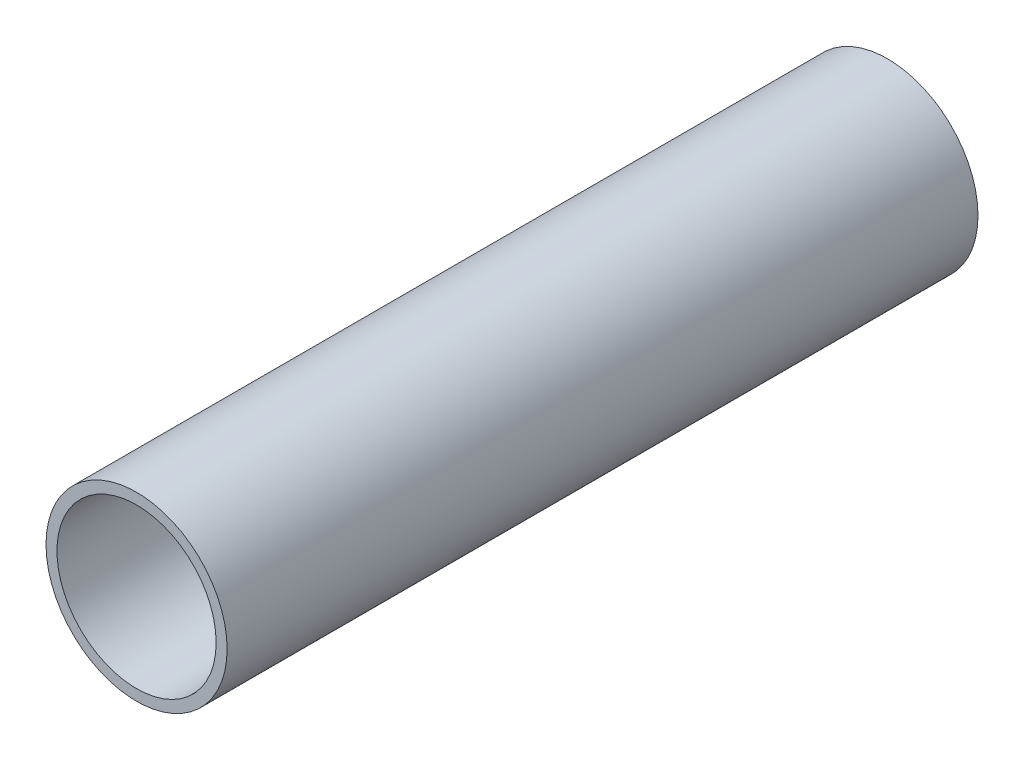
from build123d import *

# Parameters (mm, degrees)
SKIZZE1_R               = 30.15
SKIZZE1_R_2             = 26.5
LINEAR_AUSTRAGEN1_DEPTH = 250


with BuildPart() as part:
    # Skizze1 → Linear austragen1 (new body)
    with BuildSketch(Plane.XY):
        with Locations((9000, 2469.85)):
            Circle(SKIZZE1_R)
        with Locations((9000, 2469.85)):
            Circle(SKIZZE1_R_2, mode=Mode.SUBTRACT)
    extrude(amount=LINEAR_AUSTRAGEN1_DEPTH)


solid = part.part
